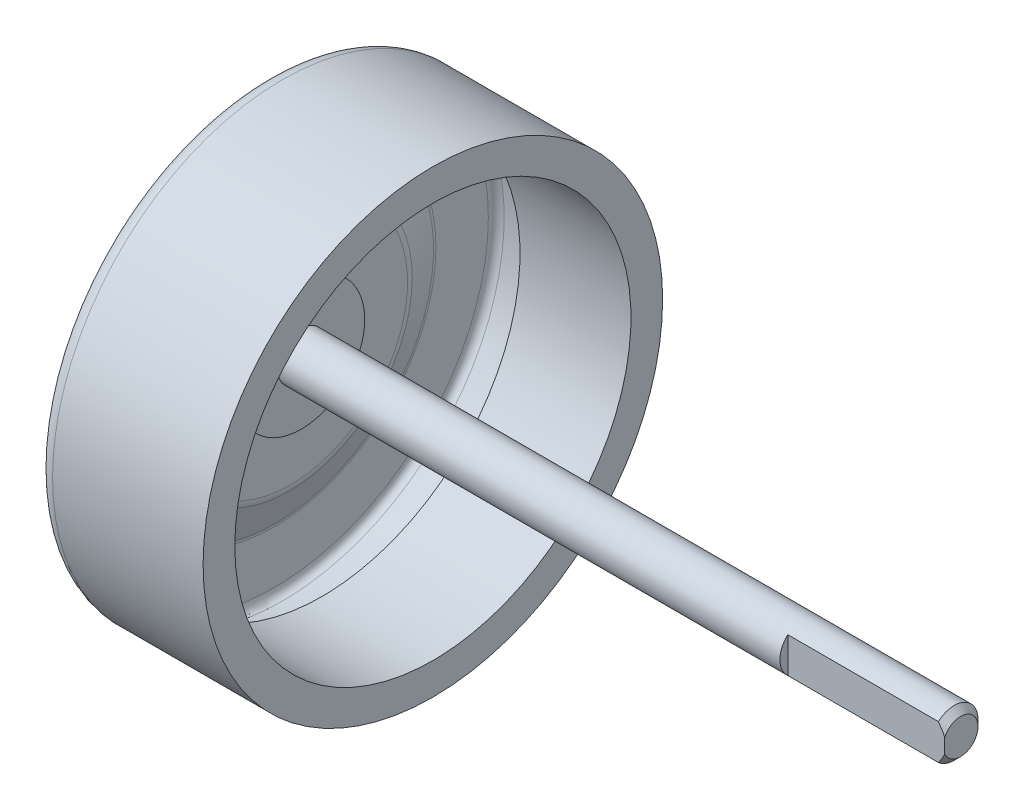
from build123d import *

# Parameters (mm, degrees)
CHANFREIN1_SIZE         = 0.4
ESQUISSE2_W             = 10.445772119
ESQUISSE2_H             = 5.672216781
ENL_V_MAT_EXTRU_1_DEPTH = 0.5


with BuildPart() as part:
    # Esquisse1 → R_volution2 (revolve)
    with BuildSketch(Plane.XY, mode=Mode.PRIVATE) as r_volution2_sk:
        with BuildLine():
            Line((10.5, 14.5), (1, 14.5))
            ThreePointArc((1, 14.5), (0.292893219, 14.207106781), (0, 13.5))
            Line((0, 13.5), (0, 10.192582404))
            ThreePointArc((0, 10.192582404), (0.018043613, 10.003474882), (0.071523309, 9.821191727))
            Line((0.071523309, 9.821191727), (0.964238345, 7.589404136))
            ThreePointArc((0.964238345, 7.589404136), (0.990978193, 7.498262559), (1, 7.403708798))
            Line((1, 7.403708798), (1, 4))
            Line((1, 4), (0.8, 4))
            Line((0.8, 4), (0.8, 0))
            Line((0.8, 0), (43.8, 0))
            Line((43.8, 0), (43.8, 1.5))
            Line((43.8, 1.5), (2.2, 1.5))
            Line((2.2, 1.5), (2.2, 4))
            Line((2.2, 4), (1.5, 4))
            Line((1.5, 4), (1.5, 7.403708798))
            ThreePointArc((1.5, 7.403708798), (1.481956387, 7.592816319), (1.428476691, 7.775099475))
            Line((1.428476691, 7.775099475), (0.535761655, 10.006887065))
            ThreePointArc((0.535761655, 10.006887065), (0.509021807, 10.098028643), (0.5, 10.192582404))
            Line((0.5, 10.192582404), (0.5, 13.5))
            ThreePointArc((0.5, 13.5), (0.646446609, 13.853553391), (1, 14))
            Line((1, 14), (3.5, 14))
            Line((3.5, 14), (3.5, 12.5))
            Line((3.5, 12.5), (10.5, 12.5))
            Line((10.5, 12.5), (10.5, 14.5))
        make_face()
    revolve(r_volution2_sk.sketch.rotate(Axis((-6.4357275, 0, 0), (1, 0, 0)), 90), axis=Axis((-6.4357275, 0, 0), (1, 0, 0)))

    # Chanfrein1
    chanfrein1_edges = [part.edges().sort_by_distance(p)[0] for p in [
        (43.8, 0, -1.5),
    ]]
    chamfer(chanfrein1_edges, length=CHANFREIN1_SIZE)

    # Esquisse2 → Enl_v. mat.-Extru.1 (cut)
    with BuildSketch(Plane.XY.offset(1.5)):
        with Locations((39.12288606, 0.101289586)):
            Rectangle(ESQUISSE2_W, ESQUISSE2_H)
    extrude(amount=-ENL_V_MAT_EXTRU_1_DEPTH, mode=Mode.SUBTRACT)


solid = part.part
